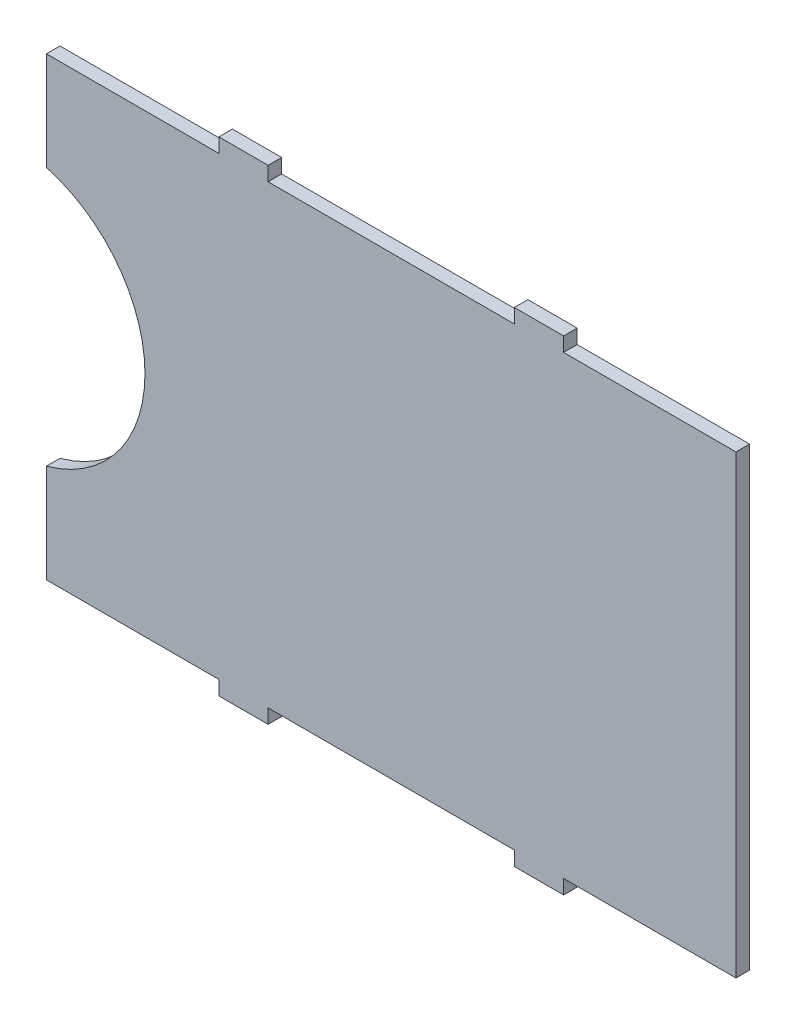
from build123d import *

# Parameters (mm, degrees)
SALIENTE_EXTRUIR1_DEPTH = 5.5
CORTAR_EXTRUIR1_DEPTH   = 5.5


with BuildPart() as part:
    # Croquis2 → Saliente-Extruir1 (new body)
    with BuildSketch(Plane.XY):
        Polygon((0, 0), (0, 185), (70, 185), (70, 190.8), (90, 190.8), (90, 185), (190, 185), (190, 190.8), (210, 190.8), (210, 185), (280, 185), (280, 0), (210, 0), (210, -5.8), (190, -5.8), (190, 0), (90, 0), (90, -5.8), (70, -5.8), (70, 0), align=None)
    extrude(amount=SALIENTE_EXTRUIR1_DEPTH)

    # Croquis3 → Cortar-Extruir1 (cut)
    with BuildSketch(Plane.XY.offset(5.5)):
        with BuildLine():
            Line((0, 145), (0, 40))
            ThreePointArc((0, 40), (40, 92.5), (0, 145))
        make_face()
    extrude(amount=-CORTAR_EXTRUIR1_DEPTH, mode=Mode.SUBTRACT)


solid = part.part
